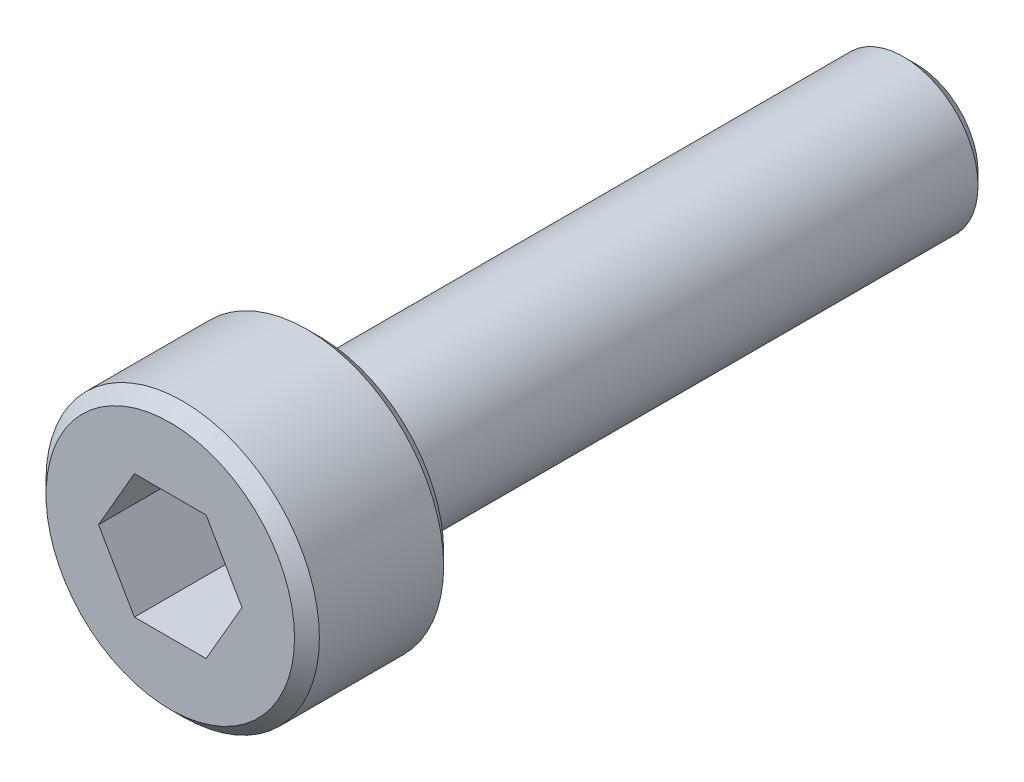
from build123d import *

# Parameters (mm, degrees)
SKETCH1_R           = 1.5
BOSS_EXTRUDE1_DEPTH = 12
SKETCH2_R           = 2.75
BOSS_EXTRUDE2_DEPTH = 3
CHAMFER1_SIZE       = 0.25
CUT_EXTRUDE1_DEPTH  = 2


with BuildPart() as part:
    # Sketch1 → Boss-Extrude1 (new body)
    with BuildSketch(Plane(origin=(0, 0, 0), x_dir=(0, 1, 0), z_dir=(0, 0, 1))):
        with Locations(Location((0, 0, 0), (0, 0, 270))):
            Circle(SKETCH1_R)
    extrude(amount=BOSS_EXTRUDE1_DEPTH)

    # Sketch2 → Boss-Extrude2 (add)
    with BuildSketch(Plane.XY.offset(12)):
        Circle(SKETCH2_R)
    extrude(amount=BOSS_EXTRUDE2_DEPTH)

    # Chamfer1
    chamfer1_edges = [part.edges().sort_by_distance(p)[0] for p in [
        (-1.5, 0, 0),
        (-2.75, 0, 12),
        (-2.75, 0, 15),
    ]]
    chamfer(chamfer1_edges, length=CHAMFER1_SIZE)

    # Sketch3 → Cut-Extrude1 (cut)
    with BuildSketch(Plane.XY.offset(15)):
        Polygon((1.443375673, 0), (0.721687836, 1.25), (-0.721687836, 1.25), (-1.443375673, 0), (-0.721687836, -1.25), (0.721687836, -1.25), align=None)
    extrude(amount=-CUT_EXTRUDE1_DEPTH, mode=Mode.SUBTRACT)


solid = part.part
